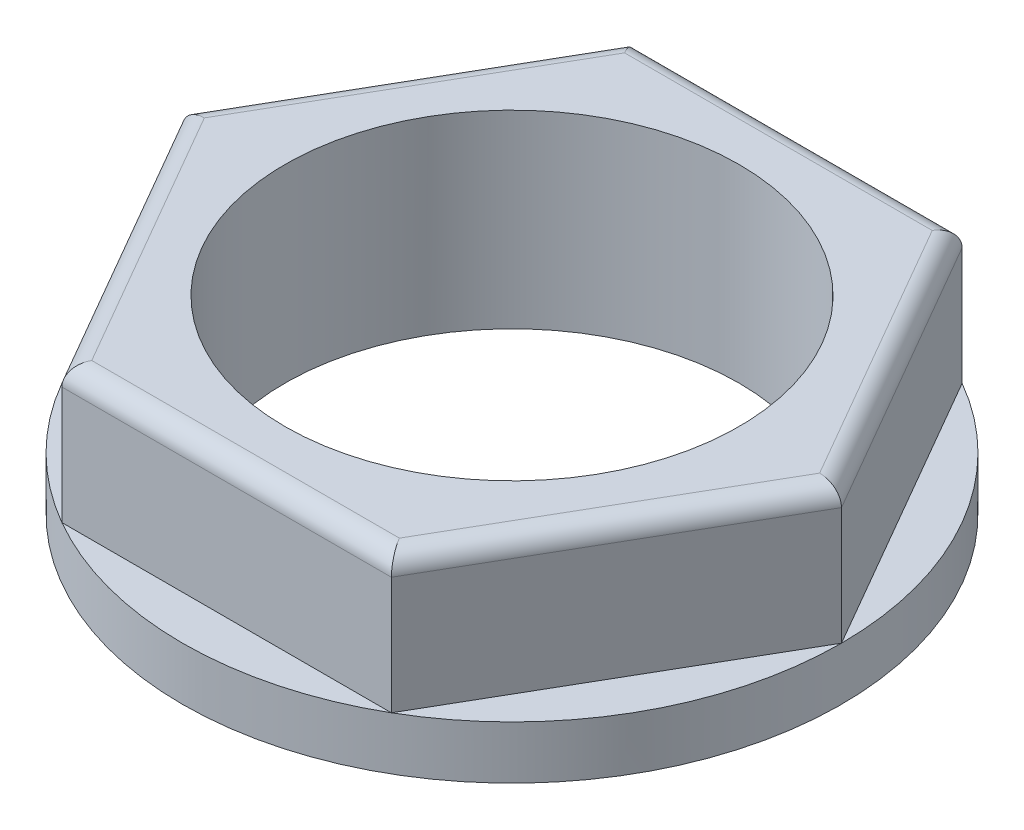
ISO-10303-21;
HEADER;
FILE_DESCRIPTION(('STEP AP214'),'2;1');
FILE_NAME('part.step','',(''),(''),'','','');
FILE_SCHEMA(('AUTOMOTIVE_DESIGN { 1 0 10303 214 1 1 1 1 }'));
ENDSEC;
DATA;
#1=APPLICATION_CONTEXT('core data for automotive mechanical design processes');
#2=APPLICATION_PROTOCOL_DEFINITION('international standard','automotive_design',2000,#1);
#3=PRODUCT_CONTEXT('',#1,'mechanical');
#4=PRODUCT('Part','Part','',(#3));
#5=PRODUCT_RELATED_PRODUCT_CATEGORY('part','',(#4));
#6=PRODUCT_DEFINITION_FORMATION('','',#4);
#7=PRODUCT_DEFINITION_CONTEXT('part definition',#1,'design');
#8=PRODUCT_DEFINITION('design','',#6,#7);
#9=PRODUCT_DEFINITION_SHAPE('','',#8);
#10=(LENGTH_UNIT() NAMED_UNIT(*) SI_UNIT(.MILLI.,.METRE.));
#11=(NAMED_UNIT(*) PLANE_ANGLE_UNIT() SI_UNIT($,.RADIAN.));
#12=(NAMED_UNIT(*) SI_UNIT($,.STERADIAN.) SOLID_ANGLE_UNIT());
#13=UNCERTAINTY_MEASURE_WITH_UNIT(LENGTH_MEASURE(1.E-05),#10,'distance_accuracy_value','');
#14=(GEOMETRIC_REPRESENTATION_CONTEXT(3) GLOBAL_UNCERTAINTY_ASSIGNED_CONTEXT((#13)) GLOBAL_UNIT_ASSIGNED_CONTEXT((#10,
#11,#12)) REPRESENTATION_CONTEXT('',''));
#15=CARTESIAN_POINT('',(0.,0.,0.));
#16=DIRECTION('',(0.,0.,1.));
#17=DIRECTION('',(1.,0.,0.));
#18=AXIS2_PLACEMENT_3D('',#15,#16,#17);
#19=CARTESIAN_POINT('',(0.,1.4,0.));
#20=DIRECTION('',(0.,1.,0.));
#21=DIRECTION('',(0.,0.,1.));
#22=AXIS2_PLACEMENT_3D('',#19,#20,#21);
#23=PLANE('',#22);
#24=DIRECTION('',(-0.500000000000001,0.,-0.866025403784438));
#25=VECTOR('',#24,1.);
#26=CARTESIAN_POINT('',(8.7,1.4,0.));
#27=LINE('',#26,#25);
#28=CARTESIAN_POINT('',(8.7,1.4,0.));
#29=VERTEX_POINT('',#28);
#30=CARTESIAN_POINT('',(4.34999999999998,1.4,-7.53442101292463));
#31=VERTEX_POINT('',#30);
#32=EDGE_CURVE('E139',#29,#31,#27,.T.);
#33=ORIENTED_EDGE('',*,*,#32,.F.);
#34=CARTESIAN_POINT('',(0.,1.4,0.));
#35=DIRECTION('',(0.,1.,0.));
#36=DIRECTION('',(0.,0.,1.));
#37=AXIS2_PLACEMENT_3D('',#34,#35,#36);
#38=CIRCLE('',#37,8.7);
#39=EDGE_CURVE('E123',#29,#31,#38,.T.);
#40=ORIENTED_EDGE('',*,*,#39,.T.);
#41=EDGE_LOOP('',(#33,#40));
#42=FACE_BOUND('',#41,.T.);
#43=ADVANCED_FACE('F33',(#42),#23,.T.);
#44=DIRECTION('',(0.500000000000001,0.,-0.866025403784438));
#45=VECTOR('',#44,1.);
#46=CARTESIAN_POINT('',(4.34999999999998,1.4,7.53442101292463));
#47=LINE('',#46,#45);
#48=CARTESIAN_POINT('',(4.34999999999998,1.4,7.53442101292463));
#49=VERTEX_POINT('',#48);
#50=EDGE_CURVE('E150',#49,#29,#47,.T.);
#51=ORIENTED_EDGE('',*,*,#50,.F.);
#52=EDGE_CURVE('E161',#49,#29,#38,.T.);
#53=ORIENTED_EDGE('',*,*,#52,.T.);
#54=EDGE_LOOP('',(#51,#53));
#55=FACE_BOUND('',#54,.T.);
#56=ADVANCED_FACE('F249',(#55),#23,.T.);
#57=DIRECTION('',(1.,0.,0.));
#58=VECTOR('',#57,1.);
#59=CARTESIAN_POINT('',(-4.34999999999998,1.4,7.53442101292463));
#60=LINE('',#59,#58);
#61=CARTESIAN_POINT('',(-4.34999999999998,1.4,7.53442101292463));
#62=VERTEX_POINT('',#61);
#63=EDGE_CURVE('E147',#62,#49,#60,.T.);
#64=ORIENTED_EDGE('',*,*,#63,.F.);
#65=EDGE_CURVE('E165',#62,#49,#38,.T.);
#66=ORIENTED_EDGE('',*,*,#65,.T.);
#67=EDGE_LOOP('',(#64,#66));
#68=FACE_BOUND('',#67,.T.);
#69=ADVANCED_FACE('F247',(#68),#23,.T.);
#70=DIRECTION('',(0.500000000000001,0.,0.866025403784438));
#71=VECTOR('',#70,1.);
#72=CARTESIAN_POINT('',(-8.7,1.4,0.));
#73=LINE('',#72,#71);
#74=CARTESIAN_POINT('',(-8.7,1.4,0.));
#75=VERTEX_POINT('',#74);
#76=EDGE_CURVE('E136',#75,#62,#73,.T.);
#77=ORIENTED_EDGE('',*,*,#76,.F.);
#78=EDGE_CURVE('E133',#75,#62,#38,.T.);
#79=ORIENTED_EDGE('',*,*,#78,.T.);
#80=EDGE_LOOP('',(#77,#79));
#81=FACE_BOUND('',#80,.T.);
#82=ADVANCED_FACE('F244',(#81),#23,.T.);
#83=DIRECTION('',(-0.500000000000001,0.,0.866025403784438));
#84=VECTOR('',#83,1.);
#85=CARTESIAN_POINT('',(-4.34999999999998,1.4,-7.53442101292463));
#86=LINE('',#85,#84);
#87=CARTESIAN_POINT('',(-4.34999999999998,1.4,-7.53442101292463));
#88=VERTEX_POINT('',#87);
#89=EDGE_CURVE('E107',#88,#75,#86,.T.);
#90=ORIENTED_EDGE('',*,*,#89,.F.);
#91=EDGE_CURVE('E124',#88,#75,#38,.T.);
#92=ORIENTED_EDGE('',*,*,#91,.T.);
#93=EDGE_LOOP('',(#90,#92));
#94=FACE_BOUND('',#93,.T.);
#95=ADVANCED_FACE('F135',(#94),#23,.T.);
#96=CARTESIAN_POINT('',(0.,1.4,0.));
#97=DIRECTION('',(0.,-1.,0.));
#98=DIRECTION('',(0.,0.,-1.));
#99=AXIS2_PLACEMENT_3D('',#96,#97,#98);
#100=CYLINDRICAL_SURFACE('',#99,8.7);
#101=ORIENTED_EDGE('',*,*,#52,.F.);
#102=ORIENTED_EDGE('',*,*,#65,.F.);
#103=ORIENTED_EDGE('',*,*,#78,.F.);
#104=ORIENTED_EDGE('',*,*,#91,.F.);
#105=EDGE_CURVE('E116',#31,#88,#38,.T.);
#106=ORIENTED_EDGE('',*,*,#105,.F.);
#107=ORIENTED_EDGE('',*,*,#39,.F.);
#108=EDGE_LOOP('',(#101,#102,#103,#104,#106,#107));
#109=FACE_BOUND('',#108,.T.);
#110=CARTESIAN_POINT('',(0.,0.,0.));
#111=DIRECTION('',(0.,1.,0.));
#112=DIRECTION('',(0.,0.,1.));
#113=AXIS2_PLACEMENT_3D('',#110,#111,#112);
#114=CIRCLE('',#113,8.7);
#115=CARTESIAN_POINT('',(0.,0.,8.7));
#116=VERTEX_POINT('',#115);
#117=EDGE_CURVE('E160',#116,#116,#114,.T.);
#118=ORIENTED_EDGE('',*,*,#117,.T.);
#119=EDGE_LOOP('',(#118));
#120=FACE_BOUND('',#119,.T.);
#121=ADVANCED_FACE('F129',(#109,#120),#100,.T.);
#122=DIRECTION('',(-1.,0.,0.));
#123=VECTOR('',#122,1.);
#124=CARTESIAN_POINT('',(4.34999999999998,1.4,-7.53442101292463));
#125=LINE('',#124,#123);
#126=EDGE_CURVE('E119',#31,#88,#125,.T.);
#127=ORIENTED_EDGE('',*,*,#126,.F.);
#128=ORIENTED_EDGE('',*,*,#105,.T.);
#129=EDGE_LOOP('',(#127,#128));
#130=FACE_BOUND('',#129,.T.);
#131=ADVANCED_FACE('F118',(#130),#23,.T.);
#132=CARTESIAN_POINT('',(0.,0.,0.));
#133=DIRECTION('',(0.,1.,0.));
#134=DIRECTION('',(0.,0.,1.));
#135=AXIS2_PLACEMENT_3D('',#132,#133,#134);
#136=PLANE('',#135);
#137=CARTESIAN_POINT('',(0.,0.,0.));
#138=DIRECTION('',(0.,-1.,0.));
#139=DIRECTION('',(0.,0.,-1.));
#140=AXIS2_PLACEMENT_3D('',#137,#138,#139);
#141=CIRCLE('',#140,5.9944);
#142=CARTESIAN_POINT('',(0.,0.,-5.9944));
#143=VERTEX_POINT('',#142);
#144=EDGE_CURVE('E417',#143,#143,#141,.T.);
#145=ORIENTED_EDGE('',*,*,#144,.F.);
#146=EDGE_LOOP('',(#145));
#147=FACE_BOUND('',#146,.T.);
#148=ORIENTED_EDGE('',*,*,#117,.F.);
#149=EDGE_LOOP('',(#148));
#150=FACE_BOUND('',#149,.T.);
#151=ADVANCED_FACE('F260',(#147,#150),#136,.F.);
#152=CARTESIAN_POINT('',(8.7,5.,0.));
#153=DIRECTION('',(-0.866025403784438,0.,0.500000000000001));
#154=DIRECTION('',(0.500000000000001,0.,0.866025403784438));
#155=AXIS2_PLACEMENT_3D('',#152,#153,#154);
#156=PLANE('',#155);
#157=DIRECTION('',(0.,-1.,0.));
#158=VECTOR('',#157,1.);
#159=CARTESIAN_POINT('',(4.34999999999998,5.,-7.53442101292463));
#160=LINE('',#159,#158);
#161=CARTESIAN_POINT('',(4.34999999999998,4.5,-7.53442101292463));
#162=VERTEX_POINT('',#161);
#163=EDGE_CURVE('E110',#162,#31,#160,.T.);
#164=ORIENTED_EDGE('',*,*,#163,.F.);
#165=DIRECTION('',(-0.500000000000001,0.,-0.866025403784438));
#166=VECTOR('',#165,1.);
#167=CARTESIAN_POINT('',(8.7,4.5,0.));
#168=LINE('',#167,#166);
#169=CARTESIAN_POINT('',(8.7,4.5,0.));
#170=VERTEX_POINT('',#169);
#171=EDGE_CURVE('E11',#162,#170,#168,.F.);
#172=ORIENTED_EDGE('',*,*,#171,.T.);
#173=DIRECTION('',(0.,-1.,0.));
#174=VECTOR('',#173,1.);
#175=CARTESIAN_POINT('',(8.7,5.,0.));
#176=LINE('',#175,#174);
#177=EDGE_CURVE('E153',#170,#29,#176,.T.);
#178=ORIENTED_EDGE('',*,*,#177,.T.);
#179=ORIENTED_EDGE('',*,*,#32,.T.);
#180=EDGE_LOOP('',(#164,#172,#178,#179));
#181=FACE_BOUND('',#180,.T.);
#182=ADVANCED_FACE('F221',(#181),#156,.F.);
#183=CARTESIAN_POINT('',(4.34999999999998,5.,-7.53442101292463));
#184=DIRECTION('',(0.,0.,1.));
#185=DIRECTION('',(1.,0.,0.));
#186=AXIS2_PLACEMENT_3D('',#183,#184,#185);
#187=PLANE('',#186);
#188=DIRECTION('',(0.,-1.,0.));
#189=VECTOR('',#188,1.);
#190=CARTESIAN_POINT('',(-4.34999999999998,5.,-7.53442101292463));
#191=LINE('',#190,#189);
#192=CARTESIAN_POINT('',(-4.34999999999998,4.5,-7.53442101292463));
#193=VERTEX_POINT('',#192);
#194=EDGE_CURVE('E103',#193,#88,#191,.T.);
#195=ORIENTED_EDGE('',*,*,#194,.F.);
#196=DIRECTION('',(-1.,0.,0.));
#197=VECTOR('',#196,1.);
#198=CARTESIAN_POINT('',(4.34999999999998,4.5,-7.53442101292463));
#199=LINE('',#198,#197);
#200=EDGE_CURVE('E42',#193,#162,#199,.F.);
#201=ORIENTED_EDGE('',*,*,#200,.T.);
#202=ORIENTED_EDGE('',*,*,#163,.T.);
#203=ORIENTED_EDGE('',*,*,#126,.T.);
#204=EDGE_LOOP('',(#195,#201,#202,#203));
#205=FACE_BOUND('',#204,.T.);
#206=ADVANCED_FACE('F138',(#205),#187,.F.);
#207=CARTESIAN_POINT('',(-4.34999999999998,5.,-7.53442101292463));
#208=DIRECTION('',(0.866025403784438,0.,0.500000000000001));
#209=DIRECTION('',(0.500000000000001,0.,-0.866025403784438));
#210=AXIS2_PLACEMENT_3D('',#207,#208,#209);
#211=PLANE('',#210);
#212=DIRECTION('',(0.,-1.,0.));
#213=VECTOR('',#212,1.);
#214=CARTESIAN_POINT('',(-8.7,5.,0.));
#215=LINE('',#214,#213);
#216=CARTESIAN_POINT('',(-8.7,4.5,0.));
#217=VERTEX_POINT('',#216);
#218=EDGE_CURVE('E111',#217,#75,#215,.T.);
#219=ORIENTED_EDGE('',*,*,#218,.F.);
#220=DIRECTION('',(-0.500000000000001,0.,0.866025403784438));
#221=VECTOR('',#220,1.);
#222=CARTESIAN_POINT('',(-4.34999999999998,4.5,-7.53442101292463));
#223=LINE('',#222,#221);
#224=EDGE_CURVE('E57',#217,#193,#223,.F.);
#225=ORIENTED_EDGE('',*,*,#224,.T.);
#226=ORIENTED_EDGE('',*,*,#194,.T.);
#227=ORIENTED_EDGE('',*,*,#89,.T.);
#228=EDGE_LOOP('',(#219,#225,#226,#227));
#229=FACE_BOUND('',#228,.T.);
#230=ADVANCED_FACE('F105',(#229),#211,.F.);
#231=CARTESIAN_POINT('',(-8.7,5.,0.));
#232=DIRECTION('',(0.866025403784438,0.,-0.500000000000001));
#233=DIRECTION('',(-0.500000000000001,0.,-0.866025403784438));
#234=AXIS2_PLACEMENT_3D('',#231,#232,#233);
#235=PLANE('',#234);
#236=DIRECTION('',(0.,-1.,0.));
#237=VECTOR('',#236,1.);
#238=CARTESIAN_POINT('',(-4.34999999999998,5.,7.53442101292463));
#239=LINE('',#238,#237);
#240=CARTESIAN_POINT('',(-4.34999999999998,4.5,7.53442101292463));
#241=VERTEX_POINT('',#240);
#242=EDGE_CURVE('E157',#241,#62,#239,.T.);
#243=ORIENTED_EDGE('',*,*,#242,.F.);
#244=DIRECTION('',(0.500000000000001,0.,0.866025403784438));
#245=VECTOR('',#244,1.);
#246=CARTESIAN_POINT('',(-8.7,4.5,0.));
#247=LINE('',#246,#245);
#248=EDGE_CURVE('E185',#241,#217,#247,.F.);
#249=ORIENTED_EDGE('',*,*,#248,.T.);
#250=ORIENTED_EDGE('',*,*,#218,.T.);
#251=ORIENTED_EDGE('',*,*,#76,.T.);
#252=EDGE_LOOP('',(#243,#249,#250,#251));
#253=FACE_BOUND('',#252,.T.);
#254=ADVANCED_FACE('F241',(#253),#235,.F.);
#255=CARTESIAN_POINT('',(-4.34999999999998,5.,7.53442101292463));
#256=DIRECTION('',(0.,0.,-1.));
#257=DIRECTION('',(-1.,0.,0.));
#258=AXIS2_PLACEMENT_3D('',#255,#256,#257);
#259=PLANE('',#258);
#260=DIRECTION('',(0.,-1.,0.));
#261=VECTOR('',#260,1.);
#262=CARTESIAN_POINT('',(4.34999999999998,5.,7.53442101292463));
#263=LINE('',#262,#261);
#264=CARTESIAN_POINT('',(4.34999999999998,4.5,7.53442101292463));
#265=VERTEX_POINT('',#264);
#266=EDGE_CURVE('E155',#265,#49,#263,.T.);
#267=ORIENTED_EDGE('',*,*,#266,.F.);
#268=DIRECTION('',(1.,0.,0.));
#269=VECTOR('',#268,1.);
#270=CARTESIAN_POINT('',(-4.34999999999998,4.5,7.53442101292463));
#271=LINE('',#270,#269);
#272=EDGE_CURVE('E183',#265,#241,#271,.F.);
#273=ORIENTED_EDGE('',*,*,#272,.T.);
#274=ORIENTED_EDGE('',*,*,#242,.T.);
#275=ORIENTED_EDGE('',*,*,#63,.T.);
#276=EDGE_LOOP('',(#267,#273,#274,#275));
#277=FACE_BOUND('',#276,.T.);
#278=ADVANCED_FACE('F238',(#277),#259,.F.);
#279=CARTESIAN_POINT('',(4.34999999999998,5.,7.53442101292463));
#280=DIRECTION('',(-0.866025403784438,0.,-0.500000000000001));
#281=DIRECTION('',(-0.500000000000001,0.,0.866025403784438));
#282=AXIS2_PLACEMENT_3D('',#279,#280,#281);
#283=PLANE('',#282);
#284=ORIENTED_EDGE('',*,*,#177,.F.);
#285=DIRECTION('',(0.500000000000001,0.,-0.866025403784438));
#286=VECTOR('',#285,1.);
#287=CARTESIAN_POINT('',(4.34999999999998,4.5,7.53442101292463));
#288=LINE('',#287,#286);
#289=EDGE_CURVE('E180',#170,#265,#288,.F.);
#290=ORIENTED_EDGE('',*,*,#289,.T.);
#291=ORIENTED_EDGE('',*,*,#266,.T.);
#292=ORIENTED_EDGE('',*,*,#50,.T.);
#293=EDGE_LOOP('',(#284,#290,#291,#292));
#294=FACE_BOUND('',#293,.T.);
#295=ADVANCED_FACE('F225',(#294),#283,.F.);
#296=CARTESIAN_POINT('',(4.34999999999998,5.,-7.53442101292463));
#297=DIRECTION('',(0.,1.,0.));
#298=DIRECTION('',(0.,0.,1.));
#299=AXIS2_PLACEMENT_3D('',#296,#297,#298);
#300=PLANE('',#299);
#301=CARTESIAN_POINT('',(0.,5.,0.));
#302=DIRECTION('',(0.,1.,0.));
#303=DIRECTION('',(0.,0.,1.));
#304=AXIS2_PLACEMENT_3D('',#301,#302,#303);
#305=CIRCLE('',#304,5.9944);
#306=CARTESIAN_POINT('',(0.,5.,5.9944));
#307=VERTEX_POINT('',#306);
#308=EDGE_CURVE('E192',#307,#307,#305,.F.);
#309=ORIENTED_EDGE('',*,*,#308,.T.);
#310=EDGE_LOOP('',(#309));
#311=FACE_BOUND('',#310,.T.);
#312=DIRECTION('',(1.,0.,0.));
#313=VECTOR('',#312,1.);
#314=CARTESIAN_POINT('',(4.34999999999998,5.,7.03442101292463));
#315=LINE('',#314,#313);
#316=CARTESIAN_POINT('',(-4.06132486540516,5.,7.03442101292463));
#317=VERTEX_POINT('',#316);
#318=CARTESIAN_POINT('',(4.06132486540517,5.,7.03442101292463));
#319=VERTEX_POINT('',#318);
#320=EDGE_CURVE('E175',#317,#319,#315,.T.);
#321=ORIENTED_EDGE('',*,*,#320,.T.);
#322=DIRECTION('',(0.500000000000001,0.,-0.866025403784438));
#323=VECTOR('',#322,1.);
#324=CARTESIAN_POINT('',(8.26698729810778,5.,-0.25));
#325=LINE('',#324,#323);
#326=CARTESIAN_POINT('',(8.12264973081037,5.,0.));
#327=VERTEX_POINT('',#326);
#328=EDGE_CURVE('E177',#319,#327,#325,.T.);
#329=ORIENTED_EDGE('',*,*,#328,.T.);
#330=DIRECTION('',(-0.500000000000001,0.,-0.866025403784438));
#331=VECTOR('',#330,1.);
#332=CARTESIAN_POINT('',(3.91698729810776,5.,-7.28442101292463));
#333=LINE('',#332,#331);
#334=CARTESIAN_POINT('',(4.06132486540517,5.,-7.03442101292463));
#335=VERTEX_POINT('',#334);
#336=EDGE_CURVE('E164',#327,#335,#333,.T.);
#337=ORIENTED_EDGE('',*,*,#336,.T.);
#338=DIRECTION('',(-1.,0.,0.));
#339=VECTOR('',#338,1.);
#340=CARTESIAN_POINT('',(-4.34999999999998,5.,-7.03442101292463));
#341=LINE('',#340,#339);
#342=CARTESIAN_POINT('',(-4.06132486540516,5.,-7.03442101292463));
#343=VERTEX_POINT('',#342);
#344=EDGE_CURVE('E169',#335,#343,#341,.T.);
#345=ORIENTED_EDGE('',*,*,#344,.T.);
#346=DIRECTION('',(-0.500000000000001,0.,0.866025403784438));
#347=VECTOR('',#346,1.);
#348=CARTESIAN_POINT('',(-8.26698729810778,5.,0.250000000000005));
#349=LINE('',#348,#347);
#350=CARTESIAN_POINT('',(-8.12264973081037,5.,0.));
#351=VERTEX_POINT('',#350);
#352=EDGE_CURVE('E171',#343,#351,#349,.T.);
#353=ORIENTED_EDGE('',*,*,#352,.T.);
#354=DIRECTION('',(0.500000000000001,0.,0.866025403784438));
#355=VECTOR('',#354,1.);
#356=CARTESIAN_POINT('',(-3.91698729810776,5.,7.28442101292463));
#357=LINE('',#356,#355);
#358=EDGE_CURVE('E173',#351,#317,#357,.T.);
#359=ORIENTED_EDGE('',*,*,#358,.T.);
#360=EDGE_LOOP('',(#321,#329,#337,#345,#353,#359));
#361=FACE_BOUND('',#360,.T.);
#362=ADVANCED_FACE('F279',(#311,#361),#300,.T.);
#363=CARTESIAN_POINT('',(-1.74198729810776,4.5,-11.0516315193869));
#364=DIRECTION('',(0.500000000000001,0.,-0.866025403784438));
#365=DIRECTION('',(-0.866025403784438,0.,-0.500000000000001));
#366=AXIS2_PLACEMENT_3D('',#363,#364,#365);
#367=CYLINDRICAL_SURFACE('',#366,0.5);
#368=CARTESIAN_POINT('',(-4.06132486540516,4.5,-7.03442101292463));
#369=DIRECTION('',(0.866025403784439,0.,-0.499999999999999));
#370=DIRECTION('',(0.499999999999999,0.,0.866025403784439));
#371=AXIS2_PLACEMENT_3D('',#368,#369,#370);
#372=ELLIPSE('',#371,0.577350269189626,0.5);
#373=EDGE_CURVE('E199',#193,#343,#372,.T.);
#374=ORIENTED_EDGE('',*,*,#373,.F.);
#375=ORIENTED_EDGE('',*,*,#224,.F.);
#376=CARTESIAN_POINT('',(-8.12264973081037,4.5,0.));
#377=DIRECTION('',(0.,0.,-1.));
#378=DIRECTION('',(1.,0.,0.));
#379=AXIS2_PLACEMENT_3D('',#376,#377,#378);
#380=ELLIPSE('',#379,0.577350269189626,0.5);
#381=EDGE_CURVE('E37',#351,#217,#380,.F.);
#382=ORIENTED_EDGE('',*,*,#381,.F.);
#383=ORIENTED_EDGE('',*,*,#352,.F.);
#384=EDGE_LOOP('',(#374,#375,#382,#383));
#385=FACE_BOUND('',#384,.T.);
#386=ADVANCED_FACE('F35',(#385),#367,.T.);
#387=CARTESIAN_POINT('',(-8.26698729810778,4.5,-0.25));
#388=DIRECTION('',(-0.500000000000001,0.,-0.866025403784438));
#389=DIRECTION('',(-0.866025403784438,0.,0.500000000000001));
#390=AXIS2_PLACEMENT_3D('',#387,#388,#389);
#391=CYLINDRICAL_SURFACE('',#390,0.5);
#392=ORIENTED_EDGE('',*,*,#381,.T.);
#393=ORIENTED_EDGE('',*,*,#248,.F.);
#394=CARTESIAN_POINT('',(-4.06132486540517,4.5,7.03442101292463));
#395=DIRECTION('',(-0.866025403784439,0.,-0.499999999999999));
#396=DIRECTION('',(0.499999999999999,0.,-0.866025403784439));
#397=AXIS2_PLACEMENT_3D('',#394,#395,#396);
#398=ELLIPSE('',#397,0.577350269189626,0.5);
#399=EDGE_CURVE('E197',#317,#241,#398,.F.);
#400=ORIENTED_EDGE('',*,*,#399,.F.);
#401=ORIENTED_EDGE('',*,*,#358,.F.);
#402=EDGE_LOOP('',(#392,#393,#400,#401));
#403=FACE_BOUND('',#402,.T.);
#404=ADVANCED_FACE('F208',(#403),#391,.T.);
#405=CARTESIAN_POINT('',(4.34999999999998,4.5,-7.03442101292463));
#406=DIRECTION('',(1.,0.,0.));
#407=DIRECTION('',(0.,0.,-1.));
#408=AXIS2_PLACEMENT_3D('',#405,#406,#407);
#409=CYLINDRICAL_SURFACE('',#408,0.5);
#410=ORIENTED_EDGE('',*,*,#373,.T.);
#411=ORIENTED_EDGE('',*,*,#344,.F.);
#412=CARTESIAN_POINT('',(4.06132486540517,4.5,-7.03442101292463));
#413=DIRECTION('',(0.866025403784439,0.,0.5));
#414=DIRECTION('',(-0.5,0.,0.866025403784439));
#415=AXIS2_PLACEMENT_3D('',#412,#413,#414);
#416=ELLIPSE('',#415,0.577350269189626,0.5);
#417=EDGE_CURVE('E194',#162,#335,#416,.T.);
#418=ORIENTED_EDGE('',*,*,#417,.F.);
#419=ORIENTED_EDGE('',*,*,#200,.F.);
#420=EDGE_LOOP('',(#410,#411,#418,#419));
#421=FACE_BOUND('',#420,.T.);
#422=ADVANCED_FACE('F213',(#421),#409,.T.);
#423=CARTESIAN_POINT('',(4.34999999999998,4.5,7.03442101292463));
#424=DIRECTION('',(-1.,0.,0.));
#425=DIRECTION('',(0.,0.,1.));
#426=AXIS2_PLACEMENT_3D('',#423,#424,#425);
#427=CYLINDRICAL_SURFACE('',#426,0.5);
#428=ORIENTED_EDGE('',*,*,#399,.T.);
#429=ORIENTED_EDGE('',*,*,#272,.F.);
#430=CARTESIAN_POINT('',(4.06132486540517,4.5,7.03442101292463));
#431=DIRECTION('',(-0.866025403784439,0.,0.499999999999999));
#432=DIRECTION('',(-0.499999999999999,0.,-0.866025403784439));
#433=AXIS2_PLACEMENT_3D('',#430,#431,#432);
#434=ELLIPSE('',#433,0.577350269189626,0.5);
#435=EDGE_CURVE('E191',#319,#265,#434,.F.);
#436=ORIENTED_EDGE('',*,*,#435,.F.);
#437=ORIENTED_EDGE('',*,*,#320,.F.);
#438=EDGE_LOOP('',(#428,#429,#436,#437));
#439=FACE_BOUND('',#438,.T.);
#440=ADVANCED_FACE('F235',(#439),#427,.T.);
#441=CARTESIAN_POINT('',(3.91698729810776,4.5,-7.28442101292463));
#442=DIRECTION('',(0.500000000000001,0.,0.866025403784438));
#443=DIRECTION('',(0.866025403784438,0.,-0.500000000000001));
#444=AXIS2_PLACEMENT_3D('',#441,#442,#443);
#445=CYLINDRICAL_SURFACE('',#444,0.5);
#446=ORIENTED_EDGE('',*,*,#417,.T.);
#447=ORIENTED_EDGE('',*,*,#336,.F.);
#448=CARTESIAN_POINT('',(8.12264973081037,4.5,0.));
#449=DIRECTION('',(0.,0.,1.));
#450=DIRECTION('',(1.,0.,0.));
#451=AXIS2_PLACEMENT_3D('',#448,#449,#450);
#452=ELLIPSE('',#451,0.577350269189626,0.5);
#453=EDGE_CURVE('E189',#170,#327,#452,.T.);
#454=ORIENTED_EDGE('',*,*,#453,.F.);
#455=ORIENTED_EDGE('',*,*,#171,.F.);
#456=EDGE_LOOP('',(#446,#447,#454,#455));
#457=FACE_BOUND('',#456,.T.);
#458=ADVANCED_FACE('F218',(#457),#445,.T.);
#459=CARTESIAN_POINT('',(10.4419872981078,4.5,-4.0172105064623));
#460=DIRECTION('',(-0.500000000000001,0.,0.866025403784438));
#461=DIRECTION('',(0.866025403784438,0.,0.500000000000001));
#462=AXIS2_PLACEMENT_3D('',#459,#460,#461);
#463=CYLINDRICAL_SURFACE('',#462,0.5);
#464=ORIENTED_EDGE('',*,*,#435,.T.);
#465=ORIENTED_EDGE('',*,*,#289,.F.);
#466=ORIENTED_EDGE('',*,*,#453,.T.);
#467=ORIENTED_EDGE('',*,*,#328,.F.);
#468=EDGE_LOOP('',(#464,#465,#466,#467));
#469=FACE_BOUND('',#468,.T.);
#470=ADVANCED_FACE('F229',(#469),#463,.T.);
#471=CARTESIAN_POINT('',(0.,21.9547235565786,0.));
#472=DIRECTION('',(0.,-1.,0.));
#473=DIRECTION('',(0.,0.,-1.));
#474=AXIS2_PLACEMENT_3D('',#471,#472,#473);
#475=CYLINDRICAL_SURFACE('',#474,5.9944);
#476=ORIENTED_EDGE('',*,*,#144,.T.);
#477=EDGE_LOOP('',(#476));
#478=FACE_BOUND('',#477,.T.);
#479=ORIENTED_EDGE('',*,*,#308,.F.);
#480=EDGE_LOOP('',(#479));
#481=FACE_BOUND('',#480,.T.);
#482=ADVANCED_FACE('F269',(#478,#481),#475,.F.);
#483=CLOSED_SHELL('',(#43,#56,#69,#82,#95,#121,#131,#151,#182,#206,#230,#254,#278,#295,#362,
#386,#404,#422,#440,#458,#470,#482));
#484=MANIFOLD_SOLID_BREP('B2',#483);
#485=ADVANCED_BREP_SHAPE_REPRESENTATION('',(#18,#484),#14);
#486=SHAPE_DEFINITION_REPRESENTATION(#9,#485);
ENDSEC;
END-ISO-10303-21;
